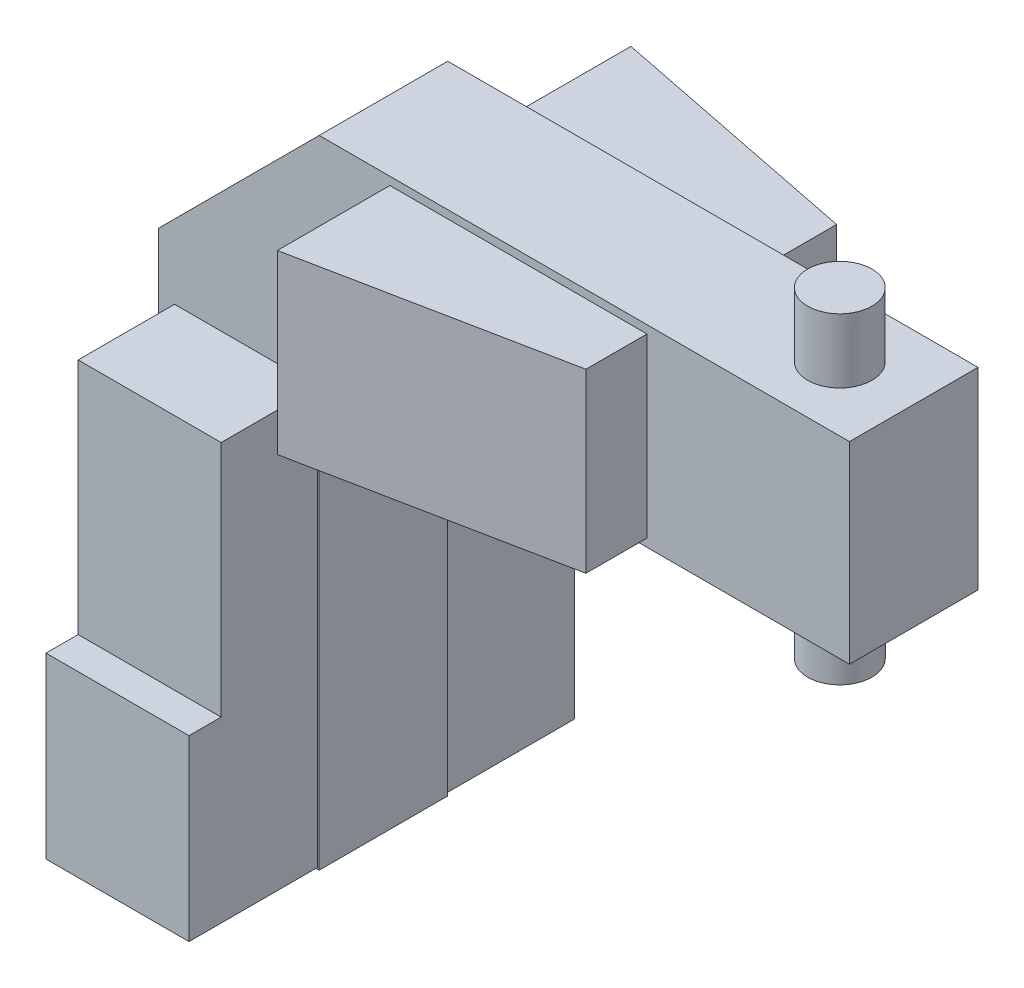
ISO-10303-21;
HEADER;
FILE_DESCRIPTION(('STEP AP214'),'2;1');
FILE_NAME('part.step','',(''),(''),'','','');
FILE_SCHEMA(('AUTOMOTIVE_DESIGN { 1 0 10303 214 1 1 1 1 }'));
ENDSEC;
DATA;
#1=APPLICATION_CONTEXT('core data for automotive mechanical design processes');
#2=APPLICATION_PROTOCOL_DEFINITION('international standard','automotive_design',2000,#1);
#3=PRODUCT_CONTEXT('',#1,'mechanical');
#4=PRODUCT('Part','Part','',(#3));
#5=PRODUCT_RELATED_PRODUCT_CATEGORY('part','',(#4));
#6=PRODUCT_DEFINITION_FORMATION('','',#4);
#7=PRODUCT_DEFINITION_CONTEXT('part definition',#1,'design');
#8=PRODUCT_DEFINITION('design','',#6,#7);
#9=PRODUCT_DEFINITION_SHAPE('','',#8);
#10=(LENGTH_UNIT() NAMED_UNIT(*) SI_UNIT(.MILLI.,.METRE.));
#11=(NAMED_UNIT(*) PLANE_ANGLE_UNIT() SI_UNIT($,.RADIAN.));
#12=(NAMED_UNIT(*) SI_UNIT($,.STERADIAN.) SOLID_ANGLE_UNIT());
#13=UNCERTAINTY_MEASURE_WITH_UNIT(LENGTH_MEASURE(1.E-05),#10,'distance_accuracy_value','');
#14=(GEOMETRIC_REPRESENTATION_CONTEXT(3) GLOBAL_UNCERTAINTY_ASSIGNED_CONTEXT((#13)) GLOBAL_UNIT_ASSIGNED_CONTEXT((#10,
#11,#12)) REPRESENTATION_CONTEXT('',''));
#15=CARTESIAN_POINT('',(0.,0.,0.));
#16=DIRECTION('',(0.,0.,1.));
#17=DIRECTION('',(1.,0.,0.));
#18=AXIS2_PLACEMENT_3D('',#15,#16,#17);
#19=CARTESIAN_POINT('',(-250.,108.15,-60.));
#20=DIRECTION('',(-1.,0.,0.));
#21=DIRECTION('',(0.,0.,1.));
#22=AXIS2_PLACEMENT_3D('',#19,#20,#21);
#23=PLANE('',#22);
#24=DIRECTION('',(0.,0.,1.));
#25=VECTOR('',#24,1.);
#26=CARTESIAN_POINT('',(-250.,163.15,-60.));
#27=LINE('',#26,#25);
#28=CARTESIAN_POINT('',(-250.,163.15,-55.));
#29=VERTEX_POINT('',#28);
#30=CARTESIAN_POINT('',(-250.,163.15,-20.));
#31=VERTEX_POINT('',#30);
#32=EDGE_CURVE('E231',#29,#31,#27,.T.);
#33=ORIENTED_EDGE('',*,*,#32,.F.);
#34=DIRECTION('',(0.,1.,0.));
#35=VECTOR('',#34,1.);
#36=CARTESIAN_POINT('',(-250.,-32.351,-55.));
#37=LINE('',#36,#35);
#38=CARTESIAN_POINT('',(-250.,108.15,-55.));
#39=VERTEX_POINT('',#38);
#40=EDGE_CURVE('E218',#39,#29,#37,.T.);
#41=ORIENTED_EDGE('',*,*,#40,.F.);
#42=DIRECTION('',(0.,0.,1.));
#43=VECTOR('',#42,1.);
#44=CARTESIAN_POINT('',(-250.,108.15,-60.));
#45=LINE('',#44,#43);
#46=CARTESIAN_POINT('',(-250.,108.15,-20.));
#47=VERTEX_POINT('',#46);
#48=EDGE_CURVE('E793',#39,#47,#45,.T.);
#49=ORIENTED_EDGE('',*,*,#48,.T.);
#50=DIRECTION('',(0.,-1.,0.));
#51=VECTOR('',#50,1.);
#52=CARTESIAN_POINT('',(-250.,108.15,-20.));
#53=LINE('',#52,#51);
#54=EDGE_CURVE('E236',#31,#47,#53,.T.);
#55=ORIENTED_EDGE('',*,*,#54,.F.);
#56=EDGE_LOOP('',(#33,#41,#49,#55));
#57=FACE_BOUND('',#56,.T.);
#58=ADVANCED_FACE('F17',(#57),#23,.T.);
#59=CARTESIAN_POINT('',(-250.,163.15,-60.));
#60=DIRECTION('',(0.,1.,0.));
#61=DIRECTION('',(0.,0.,1.));
#62=AXIS2_PLACEMENT_3D('',#59,#60,#61);
#63=PLANE('',#62);
#64=DIRECTION('',(0.,0.,1.));
#65=VECTOR('',#64,1.);
#66=CARTESIAN_POINT('',(-170.,163.15,-60.));
#67=LINE('',#66,#65);
#68=CARTESIAN_POINT('',(-170.,163.15,-39.));
#69=VERTEX_POINT('',#68);
#70=CARTESIAN_POINT('',(-170.,163.15,-20.));
#71=VERTEX_POINT('',#70);
#72=EDGE_CURVE('E233',#69,#71,#67,.T.);
#73=ORIENTED_EDGE('',*,*,#72,.F.);
#74=DIRECTION('',(-0.980580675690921,0.,-0.196116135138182));
#75=VECTOR('',#74,1.);
#76=CARTESIAN_POINT('',(-170.,163.15,-39.));
#77=LINE('',#76,#75);
#78=EDGE_CURVE('E221',#69,#29,#77,.T.);
#79=ORIENTED_EDGE('',*,*,#78,.T.);
#80=ORIENTED_EDGE('',*,*,#32,.T.);
#81=DIRECTION('',(-1.,0.,0.));
#82=VECTOR('',#81,1.);
#83=CARTESIAN_POINT('',(-250.,163.15,-20.));
#84=LINE('',#83,#82);
#85=EDGE_CURVE('E532',#71,#31,#84,.T.);
#86=ORIENTED_EDGE('',*,*,#85,.F.);
#87=EDGE_LOOP('',(#73,#79,#80,#86));
#88=FACE_BOUND('',#87,.T.);
#89=ADVANCED_FACE('F229',(#88),#63,.T.);
#90=CARTESIAN_POINT('',(-170.,163.15,-60.));
#91=DIRECTION('',(1.,0.,0.));
#92=DIRECTION('',(0.,0.,-1.));
#93=AXIS2_PLACEMENT_3D('',#90,#91,#92);
#94=PLANE('',#93);
#95=DIRECTION('',(0.,0.,1.));
#96=VECTOR('',#95,1.);
#97=CARTESIAN_POINT('',(-170.,108.15,-60.));
#98=LINE('',#97,#96);
#99=CARTESIAN_POINT('',(-170.,108.15,-39.));
#100=VERTEX_POINT('',#99);
#101=CARTESIAN_POINT('',(-170.,108.15,-20.));
#102=VERTEX_POINT('',#101);
#103=EDGE_CURVE('E242',#100,#102,#98,.T.);
#104=ORIENTED_EDGE('',*,*,#103,.F.);
#105=DIRECTION('',(0.,1.,0.));
#106=VECTOR('',#105,1.);
#107=CARTESIAN_POINT('',(-170.,-32.351,-39.));
#108=LINE('',#107,#106);
#109=EDGE_CURVE('E32',#100,#69,#108,.T.);
#110=ORIENTED_EDGE('',*,*,#109,.T.);
#111=ORIENTED_EDGE('',*,*,#72,.T.);
#112=DIRECTION('',(0.,1.,0.));
#113=VECTOR('',#112,1.);
#114=CARTESIAN_POINT('',(-170.,163.15,-20.));
#115=LINE('',#114,#113);
#116=EDGE_CURVE('E790',#102,#71,#115,.T.);
#117=ORIENTED_EDGE('',*,*,#116,.F.);
#118=EDGE_LOOP('',(#104,#110,#111,#117));
#119=FACE_BOUND('',#118,.T.);
#120=ADVANCED_FACE('F463',(#119),#94,.T.);
#121=CARTESIAN_POINT('',(-170.,108.15,-60.));
#122=DIRECTION('',(0.,-1.,0.));
#123=DIRECTION('',(0.,0.,-1.));
#124=AXIS2_PLACEMENT_3D('',#121,#122,#123);
#125=PLANE('',#124);
#126=ORIENTED_EDGE('',*,*,#48,.F.);
#127=DIRECTION('',(-0.980580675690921,0.,-0.196116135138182));
#128=VECTOR('',#127,1.);
#129=CARTESIAN_POINT('',(-170.,108.15,-39.));
#130=LINE('',#129,#128);
#131=EDGE_CURVE('E222',#100,#39,#130,.T.);
#132=ORIENTED_EDGE('',*,*,#131,.F.);
#133=ORIENTED_EDGE('',*,*,#103,.T.);
#134=DIRECTION('',(1.,0.,0.));
#135=VECTOR('',#134,1.);
#136=CARTESIAN_POINT('',(-170.,108.15,-20.));
#137=LINE('',#136,#135);
#138=EDGE_CURVE('E794',#47,#102,#137,.T.);
#139=ORIENTED_EDGE('',*,*,#138,.F.);
#140=EDGE_LOOP('',(#126,#132,#133,#139));
#141=FACE_BOUND('',#140,.T.);
#142=ADVANCED_FACE('F753',(#141),#125,.T.);
#143=CARTESIAN_POINT('',(-317.,97.65,-60.));
#144=DIRECTION('',(0.,1.,0.));
#145=DIRECTION('',(0.,0.,1.));
#146=AXIS2_PLACEMENT_3D('',#143,#144,#145);
#147=PLANE('',#146);
#148=DIRECTION('',(0.,0.,1.));
#149=VECTOR('',#148,1.);
#150=CARTESIAN_POINT('',(-272.5,97.65,-60.));
#151=LINE('',#150,#149);
#152=CARTESIAN_POINT('',(-272.5,97.65,-50.));
#153=VERTEX_POINT('',#152);
#154=CARTESIAN_POINT('',(-272.5,97.65,-20.));
#155=VERTEX_POINT('',#154);
#156=EDGE_CURVE('E801',#153,#155,#151,.T.);
#157=ORIENTED_EDGE('',*,*,#156,.F.);
#158=DIRECTION('',(-1.,0.,0.));
#159=VECTOR('',#158,1.);
#160=CARTESIAN_POINT('',(-107.,97.65,-50.));
#161=LINE('',#160,#159);
#162=CARTESIAN_POINT('',(-317.,97.65,-50.));
#163=VERTEX_POINT('',#162);
#164=EDGE_CURVE('E830',#153,#163,#161,.T.);
#165=ORIENTED_EDGE('',*,*,#164,.T.);
#166=DIRECTION('',(0.,0.,1.));
#167=VECTOR('',#166,1.);
#168=CARTESIAN_POINT('',(-317.,97.65,-60.));
#169=LINE('',#168,#167);
#170=CARTESIAN_POINT('',(-317.,97.65,-20.));
#171=VERTEX_POINT('',#170);
#172=EDGE_CURVE('E808',#163,#171,#169,.T.);
#173=ORIENTED_EDGE('',*,*,#172,.T.);
#174=DIRECTION('',(-1.,0.,0.));
#175=VECTOR('',#174,1.);
#176=CARTESIAN_POINT('',(-317.,97.65,-20.));
#177=LINE('',#176,#175);
#178=EDGE_CURVE('E824',#155,#171,#177,.T.);
#179=ORIENTED_EDGE('',*,*,#178,.F.);
#180=EDGE_LOOP('',(#157,#165,#173,#179));
#181=FACE_BOUND('',#180,.T.);
#182=ADVANCED_FACE('F745',(#181),#147,.T.);
#183=CARTESIAN_POINT('',(-272.5,97.65,-60.));
#184=DIRECTION('',(1.,0.,0.));
#185=DIRECTION('',(0.,1.,0.));
#186=AXIS2_PLACEMENT_3D('',#183,#184,#185);
#187=PLANE('',#186);
#188=DIRECTION('',(0.,0.,1.));
#189=VECTOR('',#188,1.);
#190=CARTESIAN_POINT('',(-272.5,23.65,-60.));
#191=LINE('',#190,#189);
#192=CARTESIAN_POINT('',(-272.5,23.65,-60.));
#193=VERTEX_POINT('',#192);
#194=CARTESIAN_POINT('',(-272.5,23.65,-50.));
#195=VERTEX_POINT('',#194);
#196=EDGE_CURVE('E40',#193,#195,#191,.T.);
#197=ORIENTED_EDGE('',*,*,#196,.T.);
#198=DIRECTION('',(0.,1.,0.));
#199=VECTOR('',#198,1.);
#200=CARTESIAN_POINT('',(-272.5,97.65,-50.));
#201=LINE('',#200,#199);
#202=EDGE_CURVE('E826',#195,#153,#201,.T.);
#203=ORIENTED_EDGE('',*,*,#202,.T.);
#204=ORIENTED_EDGE('',*,*,#156,.T.);
#205=DIRECTION('',(0.,1.,0.));
#206=VECTOR('',#205,1.);
#207=CARTESIAN_POINT('',(-272.5,97.65,-20.));
#208=LINE('',#207,#206);
#209=CARTESIAN_POINT('',(-272.5,-31.85,-20.));
#210=VERTEX_POINT('',#209);
#211=EDGE_CURVE('E529',#210,#155,#208,.T.);
#212=ORIENTED_EDGE('',*,*,#211,.F.);
#213=DIRECTION('',(0.,0.,1.));
#214=VECTOR('',#213,1.);
#215=CARTESIAN_POINT('',(-272.5,-31.85,-60.));
#216=LINE('',#215,#214);
#217=CARTESIAN_POINT('',(-272.5,-31.85,-60.));
#218=VERTEX_POINT('',#217);
#219=EDGE_CURVE('E803',#218,#210,#216,.T.);
#220=ORIENTED_EDGE('',*,*,#219,.F.);
#221=DIRECTION('',(0.,1.,0.));
#222=VECTOR('',#221,1.);
#223=CARTESIAN_POINT('',(-272.5,97.65,-60.));
#224=LINE('',#223,#222);
#225=EDGE_CURVE('E815',#218,#193,#224,.T.);
#226=ORIENTED_EDGE('',*,*,#225,.T.);
#227=EDGE_LOOP('',(#197,#203,#204,#212,#220,#226));
#228=FACE_BOUND('',#227,.T.);
#229=ADVANCED_FACE('F737',(#228),#187,.T.);
#230=CARTESIAN_POINT('',(-317.,-31.85,-60.));
#231=DIRECTION('',(-1.,0.,0.));
#232=DIRECTION('',(0.,0.,1.));
#233=AXIS2_PLACEMENT_3D('',#230,#231,#232);
#234=PLANE('',#233);
#235=ORIENTED_EDGE('',*,*,#172,.F.);
#236=DIRECTION('',(0.,-1.,0.));
#237=VECTOR('',#236,1.);
#238=CARTESIAN_POINT('',(-317.,97.65,-50.));
#239=LINE('',#238,#237);
#240=CARTESIAN_POINT('',(-317.,23.65,-50.));
#241=VERTEX_POINT('',#240);
#242=EDGE_CURVE('E833',#163,#241,#239,.T.);
#243=ORIENTED_EDGE('',*,*,#242,.T.);
#244=DIRECTION('',(0.,0.,-1.));
#245=VECTOR('',#244,1.);
#246=CARTESIAN_POINT('',(-317.,23.65,-50.));
#247=LINE('',#246,#245);
#248=CARTESIAN_POINT('',(-317.,23.65,-60.));
#249=VERTEX_POINT('',#248);
#250=EDGE_CURVE('E838',#241,#249,#247,.T.);
#251=ORIENTED_EDGE('',*,*,#250,.T.);
#252=DIRECTION('',(0.,-1.,0.));
#253=VECTOR('',#252,1.);
#254=CARTESIAN_POINT('',(-317.,-31.85,-60.));
#255=LINE('',#254,#253);
#256=CARTESIAN_POINT('',(-317.,-31.85,-60.));
#257=VERTEX_POINT('',#256);
#258=EDGE_CURVE('E810',#249,#257,#255,.T.);
#259=ORIENTED_EDGE('',*,*,#258,.T.);
#260=DIRECTION('',(0.,0.,1.));
#261=VECTOR('',#260,1.);
#262=CARTESIAN_POINT('',(-317.,-31.85,-60.));
#263=LINE('',#262,#261);
#264=CARTESIAN_POINT('',(-317.,-31.85,-20.));
#265=VERTEX_POINT('',#264);
#266=EDGE_CURVE('E805',#257,#265,#263,.T.);
#267=ORIENTED_EDGE('',*,*,#266,.T.);
#268=DIRECTION('',(0.,-1.,0.));
#269=VECTOR('',#268,1.);
#270=CARTESIAN_POINT('',(-317.,-31.85,-20.));
#271=LINE('',#270,#269);
#272=EDGE_CURVE('E818',#171,#265,#271,.T.);
#273=ORIENTED_EDGE('',*,*,#272,.F.);
#274=EDGE_LOOP('',(#235,#243,#251,#259,#267,#273));
#275=FACE_BOUND('',#274,.T.);
#276=ADVANCED_FACE('F450',(#275),#234,.T.);
#277=CARTESIAN_POINT('',(-317.,97.65,-60.));
#278=DIRECTION('',(0.,0.,-1.));
#279=DIRECTION('',(1.,0.,0.));
#280=AXIS2_PLACEMENT_3D('',#277,#278,#279);
#281=PLANE('',#280);
#282=ORIENTED_EDGE('',*,*,#258,.F.);
#283=DIRECTION('',(1.,0.,0.));
#284=VECTOR('',#283,1.);
#285=CARTESIAN_POINT('',(-317.,23.65,-60.));
#286=LINE('',#285,#284);
#287=EDGE_CURVE('E11',#249,#193,#286,.T.);
#288=ORIENTED_EDGE('',*,*,#287,.T.);
#289=ORIENTED_EDGE('',*,*,#225,.F.);
#290=DIRECTION('',(1.,0.,0.));
#291=VECTOR('',#290,1.);
#292=CARTESIAN_POINT('',(-272.5,-31.85,-60.));
#293=LINE('',#292,#291);
#294=EDGE_CURVE('E812',#257,#218,#293,.T.);
#295=ORIENTED_EDGE('',*,*,#294,.F.);
#296=EDGE_LOOP('',(#282,#288,#289,#295));
#297=FACE_BOUND('',#296,.T.);
#298=ADVANCED_FACE('F438',(#297),#281,.T.);
#299=CARTESIAN_POINT('',(-252.,85.65,20.));
#300=DIRECTION('',(0.,0.,1.));
#301=DIRECTION('',(1.,0.,0.));
#302=AXIS2_PLACEMENT_3D('',#299,#300,#301);
#303=PLANE('',#302);
#304=DIRECTION('',(1.,0.,0.));
#305=VECTOR('',#304,1.);
#306=CARTESIAN_POINT('',(-170.,108.15,20.));
#307=LINE('',#306,#305);
#308=CARTESIAN_POINT('',(-250.,108.15,20.));
#309=VERTEX_POINT('',#308);
#310=CARTESIAN_POINT('',(-170.,108.15,20.));
#311=VERTEX_POINT('',#310);
#312=EDGE_CURVE('E294',#309,#311,#307,.T.);
#313=ORIENTED_EDGE('',*,*,#312,.F.);
#314=DIRECTION('',(0.,-1.,0.));
#315=VECTOR('',#314,1.);
#316=CARTESIAN_POINT('',(-250.,108.15,20.));
#317=LINE('',#316,#315);
#318=CARTESIAN_POINT('',(-250.,163.15,20.));
#319=VERTEX_POINT('',#318);
#320=EDGE_CURVE('E291',#319,#309,#317,.T.);
#321=ORIENTED_EDGE('',*,*,#320,.F.);
#322=DIRECTION('',(-1.,0.,0.));
#323=VECTOR('',#322,1.);
#324=CARTESIAN_POINT('',(-250.,163.15,20.));
#325=LINE('',#324,#323);
#326=CARTESIAN_POINT('',(-170.,163.15,20.));
#327=VERTEX_POINT('',#326);
#328=EDGE_CURVE('E300',#327,#319,#325,.T.);
#329=ORIENTED_EDGE('',*,*,#328,.F.);
#330=DIRECTION('',(0.,1.,0.));
#331=VECTOR('',#330,1.);
#332=CARTESIAN_POINT('',(-170.,163.15,20.));
#333=LINE('',#332,#331);
#334=EDGE_CURVE('E297',#311,#327,#333,.T.);
#335=ORIENTED_EDGE('',*,*,#334,.F.);
#336=EDGE_LOOP('',(#313,#321,#329,#335));
#337=FACE_BOUND('',#336,.T.);
#338=DIRECTION('',(0.573576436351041,-0.819152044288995,0.));
#339=VECTOR('',#338,1.);
#340=CARTESIAN_POINT('',(-322.,-32.35,20.));
#341=LINE('',#340,#339);
#342=CARTESIAN_POINT('',(-342.,-3.78703986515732,20.));
#343=VERTEX_POINT('',#342);
#344=CARTESIAN_POINT('',(-322.,-32.35,20.));
#345=VERTEX_POINT('',#344);
#346=EDGE_CURVE('E345',#343,#345,#341,.T.);
#347=ORIENTED_EDGE('',*,*,#346,.T.);
#348=DIRECTION('',(1.,0.,0.));
#349=VECTOR('',#348,1.);
#350=CARTESIAN_POINT('',(-322.,-32.35,20.));
#351=LINE('',#350,#349);
#352=CARTESIAN_POINT('',(-272.,-32.35,20.));
#353=VERTEX_POINT('',#352);
#354=EDGE_CURVE('E348',#345,#353,#351,.T.);
#355=ORIENTED_EDGE('',*,*,#354,.T.);
#356=DIRECTION('',(0.,1.,0.));
#357=VECTOR('',#356,1.);
#358=CARTESIAN_POINT('',(-272.,-32.35,20.));
#359=LINE('',#358,#357);
#360=CARTESIAN_POINT('',(-272.,85.65,20.));
#361=VERTEX_POINT('',#360);
#362=EDGE_CURVE('E350',#353,#361,#359,.T.);
#363=ORIENTED_EDGE('',*,*,#362,.T.);
#364=CARTESIAN_POINT('',(-252.,85.65,20.));
#365=DIRECTION('',(0.,0.,-1.));
#366=DIRECTION('',(1.,0.,0.));
#367=AXIS2_PLACEMENT_3D('',#364,#365,#366);
#368=CIRCLE('',#367,20.);
#369=CARTESIAN_POINT('',(-252.,105.65,20.));
#370=VERTEX_POINT('',#369);
#371=EDGE_CURVE('E352',#361,#370,#368,.T.);
#372=ORIENTED_EDGE('',*,*,#371,.T.);
#373=DIRECTION('',(1.,0.,0.));
#374=VECTOR('',#373,1.);
#375=CARTESIAN_POINT('',(-252.,105.65,20.));
#376=LINE('',#375,#374);
#377=CARTESIAN_POINT('',(-107.,105.65,20.));
#378=VERTEX_POINT('',#377);
#379=EDGE_CURVE('E354',#370,#378,#376,.T.);
#380=ORIENTED_EDGE('',*,*,#379,.T.);
#381=DIRECTION('',(0.,1.,0.));
#382=VECTOR('',#381,1.);
#383=CARTESIAN_POINT('',(-107.,165.65,20.));
#384=LINE('',#383,#382);
#385=CARTESIAN_POINT('',(-107.,165.65,20.));
#386=VERTEX_POINT('',#385);
#387=EDGE_CURVE('E356',#378,#386,#384,.T.);
#388=ORIENTED_EDGE('',*,*,#387,.T.);
#389=DIRECTION('',(-1.,0.,0.));
#390=VECTOR('',#389,1.);
#391=CARTESIAN_POINT('',(-107.,165.65,20.));
#392=LINE('',#391,#390);
#393=CARTESIAN_POINT('',(-272.,165.65,20.));
#394=VERTEX_POINT('',#393);
#395=EDGE_CURVE('E358',#386,#394,#392,.T.);
#396=ORIENTED_EDGE('',*,*,#395,.T.);
#397=DIRECTION('',(-0.707106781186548,-0.707106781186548,0.));
#398=VECTOR('',#397,1.);
#399=CARTESIAN_POINT('',(-272.,165.65,20.));
#400=LINE('',#399,#398);
#401=CARTESIAN_POINT('',(-322.,115.65,20.));
#402=VERTEX_POINT('',#401);
#403=EDGE_CURVE('E360',#394,#402,#400,.T.);
#404=ORIENTED_EDGE('',*,*,#403,.T.);
#405=DIRECTION('',(0.,-1.,0.));
#406=VECTOR('',#405,1.);
#407=CARTESIAN_POINT('',(-322.,115.65,20.));
#408=LINE('',#407,#406);
#409=CARTESIAN_POINT('',(-322.,21.65,20.));
#410=VERTEX_POINT('',#409);
#411=EDGE_CURVE('E362',#402,#410,#408,.T.);
#412=ORIENTED_EDGE('',*,*,#411,.T.);
#413=DIRECTION('',(-1.,0.,0.));
#414=VECTOR('',#413,1.);
#415=CARTESIAN_POINT('',(-322.,21.65,20.));
#416=LINE('',#415,#414);
#417=CARTESIAN_POINT('',(-342.,21.65,20.));
#418=VERTEX_POINT('',#417);
#419=EDGE_CURVE('E364',#410,#418,#416,.T.);
#420=ORIENTED_EDGE('',*,*,#419,.T.);
#421=DIRECTION('',(0.,-1.,0.));
#422=VECTOR('',#421,1.);
#423=CARTESIAN_POINT('',(-342.,-3.78703986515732,20.));
#424=LINE('',#423,#422);
#425=EDGE_CURVE('E366',#418,#343,#424,.T.);
#426=ORIENTED_EDGE('',*,*,#425,.T.);
#427=EDGE_LOOP('',(#347,#355,#363,#372,#380,#388,#396,#404,#412,#420,#426));
#428=FACE_BOUND('',#427,.T.);
#429=DIRECTION('',(0.,-1.,0.));
#430=VECTOR('',#429,1.);
#431=CARTESIAN_POINT('',(-317.,-31.85,20.));
#432=LINE('',#431,#430);
#433=CARTESIAN_POINT('',(-317.,97.65,20.));
#434=VERTEX_POINT('',#433);
#435=CARTESIAN_POINT('',(-317.,-31.85,20.));
#436=VERTEX_POINT('',#435);
#437=EDGE_CURVE('E267',#434,#436,#432,.T.);
#438=ORIENTED_EDGE('',*,*,#437,.F.);
#439=DIRECTION('',(-1.,0.,0.));
#440=VECTOR('',#439,1.);
#441=CARTESIAN_POINT('',(-317.,97.65,20.));
#442=LINE('',#441,#440);
#443=CARTESIAN_POINT('',(-272.5,97.65,20.));
#444=VERTEX_POINT('',#443);
#445=EDGE_CURVE('E264',#444,#434,#442,.T.);
#446=ORIENTED_EDGE('',*,*,#445,.F.);
#447=DIRECTION('',(0.,1.,0.));
#448=VECTOR('',#447,1.);
#449=CARTESIAN_POINT('',(-272.5,97.65,20.));
#450=LINE('',#449,#448);
#451=CARTESIAN_POINT('',(-272.5,-31.85,20.));
#452=VERTEX_POINT('',#451);
#453=EDGE_CURVE('E272',#452,#444,#450,.T.);
#454=ORIENTED_EDGE('',*,*,#453,.F.);
#455=DIRECTION('',(1.,0.,0.));
#456=VECTOR('',#455,1.);
#457=CARTESIAN_POINT('',(-272.5,-31.85,20.));
#458=LINE('',#457,#456);
#459=EDGE_CURVE('E269',#436,#452,#458,.T.);
#460=ORIENTED_EDGE('',*,*,#459,.F.);
#461=EDGE_LOOP('',(#438,#446,#454,#460));
#462=FACE_BOUND('',#461,.T.);
#463=ADVANCED_FACE('F435',(#337,#428,#462),#303,.T.);
#464=CARTESIAN_POINT('',(-252.,105.65,20.));
#465=DIRECTION('',(0.,1.,0.));
#466=DIRECTION('',(0.,0.,1.));
#467=AXIS2_PLACEMENT_3D('',#464,#465,#466);
#468=PLANE('',#467);
#469=DIRECTION('',(1.,0.,0.));
#470=VECTOR('',#469,1.);
#471=CARTESIAN_POINT('',(-252.,105.65,-20.));
#472=LINE('',#471,#470);
#473=CARTESIAN_POINT('',(-252.,105.65,-20.));
#474=VERTEX_POINT('',#473);
#475=CARTESIAN_POINT('',(-107.,105.65,-20.));
#476=VERTEX_POINT('',#475);
#477=EDGE_CURVE('E331',#474,#476,#472,.T.);
#478=ORIENTED_EDGE('',*,*,#477,.T.);
#479=DIRECTION('',(0.,0.,-1.));
#480=VECTOR('',#479,1.);
#481=CARTESIAN_POINT('',(-107.,105.65,20.));
#482=LINE('',#481,#480);
#483=EDGE_CURVE('E386',#378,#476,#482,.T.);
#484=ORIENTED_EDGE('',*,*,#483,.F.);
#485=ORIENTED_EDGE('',*,*,#379,.F.);
#486=DIRECTION('',(0.,0.,-1.));
#487=VECTOR('',#486,1.);
#488=CARTESIAN_POINT('',(-252.,105.65,20.));
#489=LINE('',#488,#487);
#490=EDGE_CURVE('E389',#370,#474,#489,.T.);
#491=ORIENTED_EDGE('',*,*,#490,.T.);
#492=EDGE_LOOP('',(#478,#484,#485,#491));
#493=FACE_BOUND('',#492,.T.);
#494=CARTESIAN_POINT('',(-130.,105.65,0.));
#495=DIRECTION('',(0.,1.,0.));
#496=DIRECTION('',(0.,0.,1.));
#497=AXIS2_PLACEMENT_3D('',#494,#495,#496);
#498=CIRCLE('',#497,10.);
#499=CARTESIAN_POINT('',(-130.,105.65,10.));
#500=VERTEX_POINT('',#499);
#501=EDGE_CURVE('E318',#500,#500,#498,.F.);
#502=ORIENTED_EDGE('',*,*,#501,.F.);
#503=EDGE_LOOP('',(#502));
#504=FACE_BOUND('',#503,.T.);
#505=ADVANCED_FACE('F437',(#493,#504),#468,.F.);
#506=CARTESIAN_POINT('',(-107.,165.65,20.));
#507=DIRECTION('',(0.,-1.,0.));
#508=DIRECTION('',(0.,0.,-1.));
#509=AXIS2_PLACEMENT_3D('',#506,#507,#508);
#510=PLANE('',#509);
#511=DIRECTION('',(-1.,0.,0.));
#512=VECTOR('',#511,1.);
#513=CARTESIAN_POINT('',(-107.,165.65,-20.));
#514=LINE('',#513,#512);
#515=CARTESIAN_POINT('',(-107.,165.65,-20.));
#516=VERTEX_POINT('',#515);
#517=CARTESIAN_POINT('',(-272.,165.65,-20.));
#518=VERTEX_POINT('',#517);
#519=EDGE_CURVE('E335',#516,#518,#514,.T.);
#520=ORIENTED_EDGE('',*,*,#519,.T.);
#521=DIRECTION('',(0.,0.,-1.));
#522=VECTOR('',#521,1.);
#523=CARTESIAN_POINT('',(-272.,165.65,20.));
#524=LINE('',#523,#522);
#525=EDGE_CURVE('E380',#394,#518,#524,.T.);
#526=ORIENTED_EDGE('',*,*,#525,.F.);
#527=ORIENTED_EDGE('',*,*,#395,.F.);
#528=DIRECTION('',(0.,0.,-1.));
#529=VECTOR('',#528,1.);
#530=CARTESIAN_POINT('',(-107.,165.65,20.));
#531=LINE('',#530,#529);
#532=EDGE_CURVE('E383',#386,#516,#531,.T.);
#533=ORIENTED_EDGE('',*,*,#532,.T.);
#534=EDGE_LOOP('',(#520,#526,#527,#533));
#535=FACE_BOUND('',#534,.T.);
#536=CARTESIAN_POINT('',(-130.,165.65,0.));
#537=DIRECTION('',(0.,-1.,0.));
#538=DIRECTION('',(0.,0.,-1.));
#539=AXIS2_PLACEMENT_3D('',#536,#537,#538);
#540=CIRCLE('',#539,10.);
#541=CARTESIAN_POINT('',(-130.,165.65,-9.99999999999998));
#542=VERTEX_POINT('',#541);
#543=EDGE_CURVE('E322',#542,#542,#540,.F.);
#544=ORIENTED_EDGE('',*,*,#543,.F.);
#545=EDGE_LOOP('',(#544));
#546=FACE_BOUND('',#545,.T.);
#547=ADVANCED_FACE('F447',(#535,#546),#510,.F.);
#548=CARTESIAN_POINT('',(-322.,-32.35,20.));
#549=DIRECTION('',(0.819152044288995,0.573576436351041,0.));
#550=DIRECTION('',(-0.573576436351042,0.819152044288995,0.));
#551=AXIS2_PLACEMENT_3D('',#548,#549,#550);
#552=PLANE('',#551);
#553=DIRECTION('',(0.573576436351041,-0.819152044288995,0.));
#554=VECTOR('',#553,1.);
#555=CARTESIAN_POINT('',(-322.,-32.35,-20.));
#556=LINE('',#555,#554);
#557=CARTESIAN_POINT('',(-342.,-3.78703986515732,-20.));
#558=VERTEX_POINT('',#557);
#559=CARTESIAN_POINT('',(-322.,-32.35,-20.));
#560=VERTEX_POINT('',#559);
#561=EDGE_CURVE('E317',#558,#560,#556,.T.);
#562=ORIENTED_EDGE('',*,*,#561,.T.);
#563=DIRECTION('',(0.,0.,-1.));
#564=VECTOR('',#563,1.);
#565=CARTESIAN_POINT('',(-322.,-32.35,20.));
#566=LINE('',#565,#564);
#567=EDGE_CURVE('E398',#345,#560,#566,.T.);
#568=ORIENTED_EDGE('',*,*,#567,.F.);
#569=ORIENTED_EDGE('',*,*,#346,.F.);
#570=DIRECTION('',(0.,0.,-1.));
#571=VECTOR('',#570,1.);
#572=CARTESIAN_POINT('',(-342.,-3.78703986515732,20.));
#573=LINE('',#572,#571);
#574=EDGE_CURVE('E368',#343,#558,#573,.T.);
#575=ORIENTED_EDGE('',*,*,#574,.T.);
#576=EDGE_LOOP('',(#562,#568,#569,#575));
#577=FACE_BOUND('',#576,.T.);
#578=ADVANCED_FACE('F19',(#577),#552,.F.);
#579=CARTESIAN_POINT('',(-322.,-32.35,20.));
#580=DIRECTION('',(0.,1.,0.));
#581=DIRECTION('',(0.,0.,1.));
#582=AXIS2_PLACEMENT_3D('',#579,#580,#581);
#583=PLANE('',#582);
#584=DIRECTION('',(1.,0.,0.));
#585=VECTOR('',#584,1.);
#586=CARTESIAN_POINT('',(-322.,-32.35,-20.));
#587=LINE('',#586,#585);
#588=CARTESIAN_POINT('',(-272.,-32.35,-20.));
#589=VERTEX_POINT('',#588);
#590=EDGE_CURVE('E325',#560,#589,#587,.T.);
#591=ORIENTED_EDGE('',*,*,#590,.T.);
#592=DIRECTION('',(0.,0.,-1.));
#593=VECTOR('',#592,1.);
#594=CARTESIAN_POINT('',(-272.,-32.35,20.));
#595=LINE('',#594,#593);
#596=EDGE_CURVE('E395',#353,#589,#595,.T.);
#597=ORIENTED_EDGE('',*,*,#596,.F.);
#598=ORIENTED_EDGE('',*,*,#354,.F.);
#599=ORIENTED_EDGE('',*,*,#567,.T.);
#600=EDGE_LOOP('',(#591,#597,#598,#599));
#601=FACE_BOUND('',#600,.T.);
#602=ADVANCED_FACE('F580',(#601),#583,.F.);
#603=CARTESIAN_POINT('',(-272.,-32.35,20.));
#604=DIRECTION('',(-1.,0.,0.));
#605=DIRECTION('',(0.,0.,1.));
#606=AXIS2_PLACEMENT_3D('',#603,#604,#605);
#607=PLANE('',#606);
#608=DIRECTION('',(0.,1.,0.));
#609=VECTOR('',#608,1.);
#610=CARTESIAN_POINT('',(-272.,-32.35,-20.));
#611=LINE('',#610,#609);
#612=CARTESIAN_POINT('',(-272.,85.65,-20.));
#613=VERTEX_POINT('',#612);
#614=EDGE_CURVE('E327',#589,#613,#611,.T.);
#615=ORIENTED_EDGE('',*,*,#614,.T.);
#616=DIRECTION('',(0.,0.,-1.));
#617=VECTOR('',#616,1.);
#618=CARTESIAN_POINT('',(-272.,85.65,20.));
#619=LINE('',#618,#617);
#620=EDGE_CURVE('E392',#361,#613,#619,.T.);
#621=ORIENTED_EDGE('',*,*,#620,.F.);
#622=ORIENTED_EDGE('',*,*,#362,.F.);
#623=ORIENTED_EDGE('',*,*,#596,.T.);
#624=EDGE_LOOP('',(#615,#621,#622,#623));
#625=FACE_BOUND('',#624,.T.);
#626=ADVANCED_FACE('F576',(#625),#607,.F.);
#627=CARTESIAN_POINT('',(-252.,85.65,20.));
#628=DIRECTION('',(0.,0.,-1.));
#629=DIRECTION('',(-1.,0.,0.));
#630=AXIS2_PLACEMENT_3D('',#627,#628,#629);
#631=CYLINDRICAL_SURFACE('',#630,20.);
#632=CARTESIAN_POINT('',(-252.,85.65,-20.));
#633=DIRECTION('',(0.,0.,-1.));
#634=DIRECTION('',(1.,0.,0.));
#635=AXIS2_PLACEMENT_3D('',#632,#633,#634);
#636=CIRCLE('',#635,20.);
#637=EDGE_CURVE('E329',#613,#474,#636,.T.);
#638=ORIENTED_EDGE('',*,*,#637,.T.);
#639=ORIENTED_EDGE('',*,*,#490,.F.);
#640=ORIENTED_EDGE('',*,*,#371,.F.);
#641=ORIENTED_EDGE('',*,*,#620,.T.);
#642=EDGE_LOOP('',(#638,#639,#640,#641));
#643=FACE_BOUND('',#642,.T.);
#644=ADVANCED_FACE('F573',(#643),#631,.F.);
#645=CARTESIAN_POINT('',(-107.,165.65,20.));
#646=DIRECTION('',(-1.,0.,0.));
#647=DIRECTION('',(0.,0.,1.));
#648=AXIS2_PLACEMENT_3D('',#645,#646,#647);
#649=PLANE('',#648);
#650=DIRECTION('',(0.,1.,0.));
#651=VECTOR('',#650,1.);
#652=CARTESIAN_POINT('',(-107.,165.65,-20.));
#653=LINE('',#652,#651);
#654=EDGE_CURVE('E333',#476,#516,#653,.T.);
#655=ORIENTED_EDGE('',*,*,#654,.T.);
#656=ORIENTED_EDGE('',*,*,#532,.F.);
#657=ORIENTED_EDGE('',*,*,#387,.F.);
#658=ORIENTED_EDGE('',*,*,#483,.T.);
#659=EDGE_LOOP('',(#655,#656,#657,#658));
#660=FACE_BOUND('',#659,.T.);
#661=ADVANCED_FACE('F565',(#660),#649,.F.);
#662=CARTESIAN_POINT('',(-272.,165.65,20.));
#663=DIRECTION('',(0.707106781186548,-0.707106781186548,0.));
#664=DIRECTION('',(0.707106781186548,0.707106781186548,0.));
#665=AXIS2_PLACEMENT_3D('',#662,#663,#664);
#666=PLANE('',#665);
#667=DIRECTION('',(-0.707106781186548,-0.707106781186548,0.));
#668=VECTOR('',#667,1.);
#669=CARTESIAN_POINT('',(-272.,165.65,-20.));
#670=LINE('',#669,#668);
#671=CARTESIAN_POINT('',(-322.,115.65,-20.));
#672=VERTEX_POINT('',#671);
#673=EDGE_CURVE('E337',#518,#672,#670,.T.);
#674=ORIENTED_EDGE('',*,*,#673,.T.);
#675=DIRECTION('',(0.,0.,-1.));
#676=VECTOR('',#675,1.);
#677=CARTESIAN_POINT('',(-322.,115.65,20.));
#678=LINE('',#677,#676);
#679=EDGE_CURVE('E377',#402,#672,#678,.T.);
#680=ORIENTED_EDGE('',*,*,#679,.F.);
#681=ORIENTED_EDGE('',*,*,#403,.F.);
#682=ORIENTED_EDGE('',*,*,#525,.T.);
#683=EDGE_LOOP('',(#674,#680,#681,#682));
#684=FACE_BOUND('',#683,.T.);
#685=ADVANCED_FACE('F555',(#684),#666,.F.);
#686=CARTESIAN_POINT('',(-322.,115.65,20.));
#687=DIRECTION('',(1.,0.,0.));
#688=DIRECTION('',(0.,0.,-1.));
#689=AXIS2_PLACEMENT_3D('',#686,#687,#688);
#690=PLANE('',#689);
#691=DIRECTION('',(0.,-1.,0.));
#692=VECTOR('',#691,1.);
#693=CARTESIAN_POINT('',(-322.,115.65,-20.));
#694=LINE('',#693,#692);
#695=CARTESIAN_POINT('',(-322.,21.65,-20.));
#696=VERTEX_POINT('',#695);
#697=EDGE_CURVE('E339',#672,#696,#694,.T.);
#698=ORIENTED_EDGE('',*,*,#697,.T.);
#699=DIRECTION('',(0.,0.,-1.));
#700=VECTOR('',#699,1.);
#701=CARTESIAN_POINT('',(-322.,21.65,20.));
#702=LINE('',#701,#700);
#703=EDGE_CURVE('E374',#410,#696,#702,.T.);
#704=ORIENTED_EDGE('',*,*,#703,.F.);
#705=ORIENTED_EDGE('',*,*,#411,.F.);
#706=ORIENTED_EDGE('',*,*,#679,.T.);
#707=EDGE_LOOP('',(#698,#704,#705,#706));
#708=FACE_BOUND('',#707,.T.);
#709=ADVANCED_FACE('F550',(#708),#690,.F.);
#710=CARTESIAN_POINT('',(-322.,21.65,20.));
#711=DIRECTION('',(0.,-1.,0.));
#712=DIRECTION('',(1.,0.,0.));
#713=AXIS2_PLACEMENT_3D('',#710,#711,#712);
#714=PLANE('',#713);
#715=DIRECTION('',(-1.,0.,0.));
#716=VECTOR('',#715,1.);
#717=CARTESIAN_POINT('',(-322.,21.65,-20.));
#718=LINE('',#717,#716);
#719=CARTESIAN_POINT('',(-342.,21.65,-20.));
#720=VERTEX_POINT('',#719);
#721=EDGE_CURVE('E341',#696,#720,#718,.T.);
#722=ORIENTED_EDGE('',*,*,#721,.T.);
#723=DIRECTION('',(0.,0.,-1.));
#724=VECTOR('',#723,1.);
#725=CARTESIAN_POINT('',(-342.,21.65,20.));
#726=LINE('',#725,#724);
#727=EDGE_CURVE('E371',#418,#720,#726,.T.);
#728=ORIENTED_EDGE('',*,*,#727,.F.);
#729=ORIENTED_EDGE('',*,*,#419,.F.);
#730=ORIENTED_EDGE('',*,*,#703,.T.);
#731=EDGE_LOOP('',(#722,#728,#729,#730));
#732=FACE_BOUND('',#731,.T.);
#733=ADVANCED_FACE('F522',(#732),#714,.F.);
#734=CARTESIAN_POINT('',(-342.,-3.78703986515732,20.));
#735=DIRECTION('',(1.,0.,0.));
#736=DIRECTION('',(0.,0.,-1.));
#737=AXIS2_PLACEMENT_3D('',#734,#735,#736);
#738=PLANE('',#737);
#739=DIRECTION('',(0.,-1.,0.));
#740=VECTOR('',#739,1.);
#741=CARTESIAN_POINT('',(-342.,-3.78703986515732,-20.));
#742=LINE('',#741,#740);
#743=EDGE_CURVE('E343',#720,#558,#742,.T.);
#744=ORIENTED_EDGE('',*,*,#743,.T.);
#745=ORIENTED_EDGE('',*,*,#574,.F.);
#746=ORIENTED_EDGE('',*,*,#425,.F.);
#747=ORIENTED_EDGE('',*,*,#727,.T.);
#748=EDGE_LOOP('',(#744,#745,#746,#747));
#749=FACE_BOUND('',#748,.T.);
#750=ADVANCED_FACE('F516',(#749),#738,.F.);
#751=CARTESIAN_POINT('',(-252.,85.65,-20.));
#752=DIRECTION('',(0.,0.,1.));
#753=DIRECTION('',(1.,0.,0.));
#754=AXIS2_PLACEMENT_3D('',#751,#752,#753);
#755=PLANE('',#754);
#756=ORIENTED_EDGE('',*,*,#211,.T.);
#757=ORIENTED_EDGE('',*,*,#178,.T.);
#758=ORIENTED_EDGE('',*,*,#272,.T.);
#759=DIRECTION('',(1.,0.,0.));
#760=VECTOR('',#759,1.);
#761=CARTESIAN_POINT('',(-272.5,-31.85,-20.));
#762=LINE('',#761,#760);
#763=EDGE_CURVE('E821',#265,#210,#762,.T.);
#764=ORIENTED_EDGE('',*,*,#763,.T.);
#765=EDGE_LOOP('',(#756,#757,#758,#764));
#766=FACE_BOUND('',#765,.T.);
#767=ORIENTED_EDGE('',*,*,#85,.T.);
#768=ORIENTED_EDGE('',*,*,#54,.T.);
#769=ORIENTED_EDGE('',*,*,#138,.T.);
#770=ORIENTED_EDGE('',*,*,#116,.T.);
#771=EDGE_LOOP('',(#767,#768,#769,#770));
#772=FACE_BOUND('',#771,.T.);
#773=ORIENTED_EDGE('',*,*,#561,.F.);
#774=ORIENTED_EDGE('',*,*,#743,.F.);
#775=ORIENTED_EDGE('',*,*,#721,.F.);
#776=ORIENTED_EDGE('',*,*,#697,.F.);
#777=ORIENTED_EDGE('',*,*,#673,.F.);
#778=ORIENTED_EDGE('',*,*,#519,.F.);
#779=ORIENTED_EDGE('',*,*,#654,.F.);
#780=ORIENTED_EDGE('',*,*,#477,.F.);
#781=ORIENTED_EDGE('',*,*,#637,.F.);
#782=ORIENTED_EDGE('',*,*,#614,.F.);
#783=ORIENTED_EDGE('',*,*,#590,.F.);
#784=EDGE_LOOP('',(#773,#774,#775,#776,#777,#778,#779,#780,#781,#782,#783));
#785=FACE_BOUND('',#784,.T.);
#786=ADVANCED_FACE('F511',(#766,#772,#785),#755,.F.);
#787=CARTESIAN_POINT('',(-130.,185.65,0.));
#788=DIRECTION('',(0.,1.,0.));
#789=DIRECTION('',(0.,0.,1.));
#790=AXIS2_PLACEMENT_3D('',#787,#788,#789);
#791=PLANE('',#790);
#792=CARTESIAN_POINT('',(-130.,185.65,0.));
#793=DIRECTION('',(0.,1.,0.));
#794=DIRECTION('',(0.,0.,1.));
#795=AXIS2_PLACEMENT_3D('',#792,#793,#794);
#796=CIRCLE('',#795,10.);
#797=CARTESIAN_POINT('',(-130.,185.65,10.));
#798=VERTEX_POINT('',#797);
#799=EDGE_CURVE('E314',#798,#798,#796,.T.);
#800=ORIENTED_EDGE('',*,*,#799,.T.);
#801=EDGE_LOOP('',(#800));
#802=FACE_BOUND('',#801,.T.);
#803=ADVANCED_FACE('F507',(#802),#791,.T.);
#804=CARTESIAN_POINT('',(-130.,185.65,0.));
#805=DIRECTION('',(0.,-1.,0.));
#806=DIRECTION('',(0.,0.,-1.));
#807=AXIS2_PLACEMENT_3D('',#804,#805,#806);
#808=CYLINDRICAL_SURFACE('',#807,10.);
#809=ORIENTED_EDGE('',*,*,#799,.F.);
#810=EDGE_LOOP('',(#809));
#811=FACE_BOUND('',#810,.T.);
#812=ORIENTED_EDGE('',*,*,#543,.T.);
#813=EDGE_LOOP('',(#812));
#814=FACE_BOUND('',#813,.T.);
#815=ADVANCED_FACE('F510',(#811,#814),#808,.T.);
#816=CARTESIAN_POINT('',(-130.,85.65,0.));
#817=DIRECTION('',(0.,1.,0.));
#818=DIRECTION('',(0.,0.,1.));
#819=AXIS2_PLACEMENT_3D('',#816,#817,#818);
#820=CIRCLE('',#819,10.);
#821=CARTESIAN_POINT('',(-130.,85.65,10.));
#822=VERTEX_POINT('',#821);
#823=EDGE_CURVE('E311',#822,#822,#820,.T.);
#824=ORIENTED_EDGE('',*,*,#823,.T.);
#825=EDGE_LOOP('',(#824));
#826=FACE_BOUND('',#825,.T.);
#827=ORIENTED_EDGE('',*,*,#501,.T.);
#828=EDGE_LOOP('',(#827));
#829=FACE_BOUND('',#828,.T.);
#830=ADVANCED_FACE('F505',(#826,#829),#808,.T.);
#831=CARTESIAN_POINT('',(-130.,85.65,0.));
#832=DIRECTION('',(0.,1.,0.));
#833=DIRECTION('',(0.,0.,1.));
#834=AXIS2_PLACEMENT_3D('',#831,#832,#833);
#835=PLANE('',#834);
#836=ORIENTED_EDGE('',*,*,#823,.F.);
#837=EDGE_LOOP('',(#836));
#838=FACE_BOUND('',#837,.T.);
#839=ADVANCED_FACE('F501',(#838),#835,.F.);
#840=CARTESIAN_POINT('',(-250.,108.15,60.));
#841=DIRECTION('',(1.,0.,0.));
#842=DIRECTION('',(0.,0.,-1.));
#843=AXIS2_PLACEMENT_3D('',#840,#841,#842);
#844=PLANE('',#843);
#845=DIRECTION('',(0.,0.,-1.));
#846=VECTOR('',#845,1.);
#847=CARTESIAN_POINT('',(-250.,108.15,60.));
#848=LINE('',#847,#846);
#849=CARTESIAN_POINT('',(-250.,108.15,55.));
#850=VERTEX_POINT('',#849);
#851=EDGE_CURVE('E309',#850,#309,#848,.T.);
#852=ORIENTED_EDGE('',*,*,#851,.F.);
#853=DIRECTION('',(0.,1.,0.));
#854=VECTOR('',#853,1.);
#855=CARTESIAN_POINT('',(-250.,-32.351,55.));
#856=LINE('',#855,#854);
#857=CARTESIAN_POINT('',(-250.,163.15,55.));
#858=VERTEX_POINT('',#857);
#859=EDGE_CURVE('E248',#850,#858,#856,.T.);
#860=ORIENTED_EDGE('',*,*,#859,.T.);
#861=DIRECTION('',(0.,0.,-1.));
#862=VECTOR('',#861,1.);
#863=CARTESIAN_POINT('',(-250.,163.15,60.));
#864=LINE('',#863,#862);
#865=EDGE_CURVE('E303',#858,#319,#864,.T.);
#866=ORIENTED_EDGE('',*,*,#865,.T.);
#867=ORIENTED_EDGE('',*,*,#320,.T.);
#868=EDGE_LOOP('',(#852,#860,#866,#867));
#869=FACE_BOUND('',#868,.T.);
#870=ADVANCED_FACE('F497',(#869),#844,.F.);
#871=CARTESIAN_POINT('',(-170.,108.15,60.));
#872=DIRECTION('',(0.,1.,0.));
#873=DIRECTION('',(0.,0.,1.));
#874=AXIS2_PLACEMENT_3D('',#871,#872,#873);
#875=PLANE('',#874);
#876=DIRECTION('',(0.,0.,-1.));
#877=VECTOR('',#876,1.);
#878=CARTESIAN_POINT('',(-170.,108.15,60.));
#879=LINE('',#878,#877);
#880=CARTESIAN_POINT('',(-170.,108.15,39.));
#881=VERTEX_POINT('',#880);
#882=EDGE_CURVE('E307',#881,#311,#879,.T.);
#883=ORIENTED_EDGE('',*,*,#882,.F.);
#884=DIRECTION('',(0.980580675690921,0.,-0.196116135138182));
#885=VECTOR('',#884,1.);
#886=CARTESIAN_POINT('',(-170.,108.15,39.));
#887=LINE('',#886,#885);
#888=EDGE_CURVE('E238',#850,#881,#887,.T.);
#889=ORIENTED_EDGE('',*,*,#888,.F.);
#890=ORIENTED_EDGE('',*,*,#851,.T.);
#891=ORIENTED_EDGE('',*,*,#312,.T.);
#892=EDGE_LOOP('',(#883,#889,#890,#891));
#893=FACE_BOUND('',#892,.T.);
#894=ADVANCED_FACE('F493',(#893),#875,.F.);
#895=CARTESIAN_POINT('',(-170.,163.15,60.));
#896=DIRECTION('',(-1.,0.,0.));
#897=DIRECTION('',(0.,0.,1.));
#898=AXIS2_PLACEMENT_3D('',#895,#896,#897);
#899=PLANE('',#898);
#900=DIRECTION('',(0.,0.,-1.));
#901=VECTOR('',#900,1.);
#902=CARTESIAN_POINT('',(-170.,163.15,60.));
#903=LINE('',#902,#901);
#904=CARTESIAN_POINT('',(-170.,163.15,39.));
#905=VERTEX_POINT('',#904);
#906=EDGE_CURVE('E305',#905,#327,#903,.T.);
#907=ORIENTED_EDGE('',*,*,#906,.F.);
#908=DIRECTION('',(0.,1.,0.));
#909=VECTOR('',#908,1.);
#910=CARTESIAN_POINT('',(-170.,-32.351,39.));
#911=LINE('',#910,#909);
#912=EDGE_CURVE('E247',#881,#905,#911,.T.);
#913=ORIENTED_EDGE('',*,*,#912,.F.);
#914=ORIENTED_EDGE('',*,*,#882,.T.);
#915=ORIENTED_EDGE('',*,*,#334,.T.);
#916=EDGE_LOOP('',(#907,#913,#914,#915));
#917=FACE_BOUND('',#916,.T.);
#918=ADVANCED_FACE('F489',(#917),#899,.F.);
#919=CARTESIAN_POINT('',(-250.,163.15,60.));
#920=DIRECTION('',(0.,-1.,0.));
#921=DIRECTION('',(0.,0.,-1.));
#922=AXIS2_PLACEMENT_3D('',#919,#920,#921);
#923=PLANE('',#922);
#924=ORIENTED_EDGE('',*,*,#865,.F.);
#925=DIRECTION('',(-0.980580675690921,0.,0.196116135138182));
#926=VECTOR('',#925,1.);
#927=CARTESIAN_POINT('',(-170.,163.15,39.));
#928=LINE('',#927,#926);
#929=EDGE_CURVE('E240',#905,#858,#928,.T.);
#930=ORIENTED_EDGE('',*,*,#929,.F.);
#931=ORIENTED_EDGE('',*,*,#906,.T.);
#932=ORIENTED_EDGE('',*,*,#328,.T.);
#933=EDGE_LOOP('',(#924,#930,#931,#932));
#934=FACE_BOUND('',#933,.T.);
#935=ADVANCED_FACE('F486',(#934),#923,.F.);
#936=CARTESIAN_POINT('',(-317.,97.65,60.));
#937=DIRECTION('',(0.,-1.,0.));
#938=DIRECTION('',(0.,0.,-1.));
#939=AXIS2_PLACEMENT_3D('',#936,#937,#938);
#940=PLANE('',#939);
#941=DIRECTION('',(0.,0.,-1.));
#942=VECTOR('',#941,1.);
#943=CARTESIAN_POINT('',(-317.,97.65,60.));
#944=LINE('',#943,#942);
#945=CARTESIAN_POINT('',(-317.,97.65,50.));
#946=VERTEX_POINT('',#945);
#947=EDGE_CURVE('E289',#946,#434,#944,.T.);
#948=ORIENTED_EDGE('',*,*,#947,.F.);
#949=DIRECTION('',(-1.,0.,0.));
#950=VECTOR('',#949,1.);
#951=CARTESIAN_POINT('',(-107.,97.65,50.));
#952=LINE('',#951,#950);
#953=CARTESIAN_POINT('',(-272.5,97.65,50.));
#954=VERTEX_POINT('',#953);
#955=EDGE_CURVE('E257',#954,#946,#952,.T.);
#956=ORIENTED_EDGE('',*,*,#955,.F.);
#957=DIRECTION('',(0.,0.,-1.));
#958=VECTOR('',#957,1.);
#959=CARTESIAN_POINT('',(-272.5,97.65,60.));
#960=LINE('',#959,#958);
#961=EDGE_CURVE('E282',#954,#444,#960,.T.);
#962=ORIENTED_EDGE('',*,*,#961,.T.);
#963=ORIENTED_EDGE('',*,*,#445,.T.);
#964=EDGE_LOOP('',(#948,#956,#962,#963));
#965=FACE_BOUND('',#964,.T.);
#966=ADVANCED_FACE('F415',(#965),#940,.F.);
#967=CARTESIAN_POINT('',(-317.,-31.85,60.));
#968=DIRECTION('',(1.,0.,0.));
#969=DIRECTION('',(0.,0.,-1.));
#970=AXIS2_PLACEMENT_3D('',#967,#968,#969);
#971=PLANE('',#970);
#972=DIRECTION('',(0.,-1.,0.));
#973=VECTOR('',#972,1.);
#974=CARTESIAN_POINT('',(-317.,-31.85,60.));
#975=LINE('',#974,#973);
#976=CARTESIAN_POINT('',(-317.,23.65,60.));
#977=VERTEX_POINT('',#976);
#978=CARTESIAN_POINT('',(-317.,-31.85,60.));
#979=VERTEX_POINT('',#978);
#980=EDGE_CURVE('E275',#977,#979,#975,.T.);
#981=ORIENTED_EDGE('',*,*,#980,.F.);
#982=DIRECTION('',(0.,0.,1.));
#983=VECTOR('',#982,1.);
#984=CARTESIAN_POINT('',(-317.,23.65,50.));
#985=LINE('',#984,#983);
#986=CARTESIAN_POINT('',(-317.,23.65,50.));
#987=VERTEX_POINT('',#986);
#988=EDGE_CURVE('E255',#987,#977,#985,.T.);
#989=ORIENTED_EDGE('',*,*,#988,.F.);
#990=DIRECTION('',(0.,-1.,0.));
#991=VECTOR('',#990,1.);
#992=CARTESIAN_POINT('',(-317.,97.65,50.));
#993=LINE('',#992,#991);
#994=EDGE_CURVE('E251',#946,#987,#993,.T.);
#995=ORIENTED_EDGE('',*,*,#994,.F.);
#996=ORIENTED_EDGE('',*,*,#947,.T.);
#997=ORIENTED_EDGE('',*,*,#437,.T.);
#998=DIRECTION('',(0.,0.,-1.));
#999=VECTOR('',#998,1.);
#1000=CARTESIAN_POINT('',(-317.,-31.85,60.));
#1001=LINE('',#1000,#999);
#1002=EDGE_CURVE('E286',#979,#436,#1001,.T.);
#1003=ORIENTED_EDGE('',*,*,#1002,.F.);
#1004=EDGE_LOOP('',(#981,#989,#995,#996,#997,#1003));
#1005=FACE_BOUND('',#1004,.T.);
#1006=ADVANCED_FACE('F420',(#1005),#971,.F.);
#1007=CARTESIAN_POINT('',(-272.5,-31.85,60.));
#1008=DIRECTION('',(0.,1.,0.));
#1009=DIRECTION('',(-1.,0.,0.));
#1010=AXIS2_PLACEMENT_3D('',#1007,#1008,#1009);
#1011=PLANE('',#1010);
#1012=ORIENTED_EDGE('',*,*,#459,.T.);
#1013=DIRECTION('',(0.,0.,-1.));
#1014=VECTOR('',#1013,1.);
#1015=CARTESIAN_POINT('',(-272.5,-31.85,60.));
#1016=LINE('',#1015,#1014);
#1017=CARTESIAN_POINT('',(-272.5,-31.85,60.));
#1018=VERTEX_POINT('',#1017);
#1019=EDGE_CURVE('E284',#1018,#452,#1016,.T.);
#1020=ORIENTED_EDGE('',*,*,#1019,.F.);
#1021=DIRECTION('',(1.,0.,0.));
#1022=VECTOR('',#1021,1.);
#1023=CARTESIAN_POINT('',(-272.5,-31.85,60.));
#1024=LINE('',#1023,#1022);
#1025=EDGE_CURVE('E277',#979,#1018,#1024,.T.);
#1026=ORIENTED_EDGE('',*,*,#1025,.F.);
#1027=ORIENTED_EDGE('',*,*,#1002,.T.);
#1028=EDGE_LOOP('',(#1012,#1020,#1026,#1027));
#1029=FACE_BOUND('',#1028,.T.);
#1030=ADVANCED_FACE('F433',(#1029),#1011,.F.);
#1031=CARTESIAN_POINT('',(-272.5,97.65,60.));
#1032=DIRECTION('',(-1.,0.,0.));
#1033=DIRECTION('',(0.,-1.,0.));
#1034=AXIS2_PLACEMENT_3D('',#1031,#1032,#1033);
#1035=PLANE('',#1034);
#1036=DIRECTION('',(0.,-1.,0.));
#1037=VECTOR('',#1036,1.);
#1038=CARTESIAN_POINT('',(-272.5,97.65,50.));
#1039=LINE('',#1038,#1037);
#1040=CARTESIAN_POINT('',(-272.5,23.65,50.));
#1041=VERTEX_POINT('',#1040);
#1042=EDGE_CURVE('E25',#954,#1041,#1039,.T.);
#1043=ORIENTED_EDGE('',*,*,#1042,.T.);
#1044=DIRECTION('',(0.,0.,1.));
#1045=VECTOR('',#1044,1.);
#1046=CARTESIAN_POINT('',(-272.5,23.65,60.));
#1047=LINE('',#1046,#1045);
#1048=CARTESIAN_POINT('',(-272.5,23.65,60.));
#1049=VERTEX_POINT('',#1048);
#1050=EDGE_CURVE('E260',#1041,#1049,#1047,.T.);
#1051=ORIENTED_EDGE('',*,*,#1050,.T.);
#1052=DIRECTION('',(0.,1.,0.));
#1053=VECTOR('',#1052,1.);
#1054=CARTESIAN_POINT('',(-272.5,97.65,60.));
#1055=LINE('',#1054,#1053);
#1056=EDGE_CURVE('E279',#1018,#1049,#1055,.T.);
#1057=ORIENTED_EDGE('',*,*,#1056,.F.);
#1058=ORIENTED_EDGE('',*,*,#1019,.T.);
#1059=ORIENTED_EDGE('',*,*,#453,.T.);
#1060=ORIENTED_EDGE('',*,*,#961,.F.);
#1061=EDGE_LOOP('',(#1043,#1051,#1057,#1058,#1059,#1060));
#1062=FACE_BOUND('',#1061,.T.);
#1063=ADVANCED_FACE('F406',(#1062),#1035,.F.);
#1064=CARTESIAN_POINT('',(-317.,97.65,60.));
#1065=DIRECTION('',(0.,0.,1.));
#1066=DIRECTION('',(1.,0.,0.));
#1067=AXIS2_PLACEMENT_3D('',#1064,#1065,#1066);
#1068=PLANE('',#1067);
#1069=DIRECTION('',(1.,0.,0.));
#1070=VECTOR('',#1069,1.);
#1071=CARTESIAN_POINT('',(-317.,23.65,60.));
#1072=LINE('',#1071,#1070);
#1073=EDGE_CURVE('E321',#977,#1049,#1072,.T.);
#1074=ORIENTED_EDGE('',*,*,#1073,.F.);
#1075=ORIENTED_EDGE('',*,*,#980,.T.);
#1076=ORIENTED_EDGE('',*,*,#1025,.T.);
#1077=ORIENTED_EDGE('',*,*,#1056,.T.);
#1078=EDGE_LOOP('',(#1074,#1075,#1076,#1077));
#1079=FACE_BOUND('',#1078,.T.);
#1080=ADVANCED_FACE('F427',(#1079),#1068,.T.);
#1081=CARTESIAN_POINT('',(-107.,97.65,50.));
#1082=DIRECTION('',(0.,0.,-1.));
#1083=DIRECTION('',(-1.,0.,0.));
#1084=AXIS2_PLACEMENT_3D('',#1081,#1082,#1083);
#1085=PLANE('',#1084);
#1086=ORIENTED_EDGE('',*,*,#955,.T.);
#1087=ORIENTED_EDGE('',*,*,#994,.T.);
#1088=DIRECTION('',(-1.,0.,0.));
#1089=VECTOR('',#1088,1.);
#1090=CARTESIAN_POINT('',(-107.,23.65,50.));
#1091=LINE('',#1090,#1089);
#1092=EDGE_CURVE('E258',#1041,#987,#1091,.T.);
#1093=ORIENTED_EDGE('',*,*,#1092,.F.);
#1094=ORIENTED_EDGE('',*,*,#1042,.F.);
#1095=EDGE_LOOP('',(#1086,#1087,#1093,#1094));
#1096=FACE_BOUND('',#1095,.T.);
#1097=ADVANCED_FACE('F411',(#1096),#1085,.F.);
#1098=CARTESIAN_POINT('',(-107.,23.65,50.));
#1099=DIRECTION('',(0.,-1.,0.));
#1100=DIRECTION('',(0.,0.,-1.));
#1101=AXIS2_PLACEMENT_3D('',#1098,#1099,#1100);
#1102=PLANE('',#1101);
#1103=ORIENTED_EDGE('',*,*,#1092,.T.);
#1104=ORIENTED_EDGE('',*,*,#988,.T.);
#1105=ORIENTED_EDGE('',*,*,#1073,.T.);
#1106=ORIENTED_EDGE('',*,*,#1050,.F.);
#1107=EDGE_LOOP('',(#1103,#1104,#1105,#1106));
#1108=FACE_BOUND('',#1107,.T.);
#1109=ADVANCED_FACE('F425',(#1108),#1102,.F.);
#1110=CARTESIAN_POINT('',(-170.,-32.351,39.));
#1111=DIRECTION('',(-0.196116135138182,0.,-0.98058067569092));
#1112=DIRECTION('',(-0.980580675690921,0.,0.196116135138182));
#1113=AXIS2_PLACEMENT_3D('',#1110,#1111,#1112);
#1114=PLANE('',#1113);
#1115=ORIENTED_EDGE('',*,*,#888,.T.);
#1116=ORIENTED_EDGE('',*,*,#912,.T.);
#1117=ORIENTED_EDGE('',*,*,#929,.T.);
#1118=ORIENTED_EDGE('',*,*,#859,.F.);
#1119=EDGE_LOOP('',(#1115,#1116,#1117,#1118));
#1120=FACE_BOUND('',#1119,.T.);
#1121=ADVANCED_FACE('F467',(#1120),#1114,.F.);
#1122=CARTESIAN_POINT('',(-272.5,-31.85,-60.));
#1123=DIRECTION('',(0.,-1.,0.));
#1124=DIRECTION('',(1.,0.,0.));
#1125=AXIS2_PLACEMENT_3D('',#1122,#1123,#1124);
#1126=PLANE('',#1125);
#1127=ORIENTED_EDGE('',*,*,#763,.F.);
#1128=ORIENTED_EDGE('',*,*,#266,.F.);
#1129=ORIENTED_EDGE('',*,*,#294,.T.);
#1130=ORIENTED_EDGE('',*,*,#219,.T.);
#1131=EDGE_LOOP('',(#1127,#1128,#1129,#1130));
#1132=FACE_BOUND('',#1131,.T.);
#1133=ADVANCED_FACE('F470',(#1132),#1126,.T.);
#1134=CARTESIAN_POINT('',(-107.,97.65,-50.));
#1135=DIRECTION('',(0.,0.,-1.));
#1136=DIRECTION('',(-1.,0.,0.));
#1137=AXIS2_PLACEMENT_3D('',#1134,#1135,#1136);
#1138=PLANE('',#1137);
#1139=DIRECTION('',(-1.,0.,0.));
#1140=VECTOR('',#1139,1.);
#1141=CARTESIAN_POINT('',(-107.,23.65,-50.));
#1142=LINE('',#1141,#1140);
#1143=EDGE_CURVE('E831',#195,#241,#1142,.T.);
#1144=ORIENTED_EDGE('',*,*,#1143,.T.);
#1145=ORIENTED_EDGE('',*,*,#242,.F.);
#1146=ORIENTED_EDGE('',*,*,#164,.F.);
#1147=ORIENTED_EDGE('',*,*,#202,.F.);
#1148=EDGE_LOOP('',(#1144,#1145,#1146,#1147));
#1149=FACE_BOUND('',#1148,.T.);
#1150=ADVANCED_FACE('F729',(#1149),#1138,.T.);
#1151=CARTESIAN_POINT('',(-107.,23.65,-50.));
#1152=DIRECTION('',(0.,1.,0.));
#1153=DIRECTION('',(0.,0.,1.));
#1154=AXIS2_PLACEMENT_3D('',#1151,#1152,#1153);
#1155=PLANE('',#1154);
#1156=ORIENTED_EDGE('',*,*,#287,.F.);
#1157=ORIENTED_EDGE('',*,*,#250,.F.);
#1158=ORIENTED_EDGE('',*,*,#1143,.F.);
#1159=ORIENTED_EDGE('',*,*,#196,.F.);
#1160=EDGE_LOOP('',(#1156,#1157,#1158,#1159));
#1161=FACE_BOUND('',#1160,.T.);
#1162=ADVANCED_FACE('F761',(#1161),#1155,.T.);
#1163=CARTESIAN_POINT('',(-170.,-32.351,-39.));
#1164=DIRECTION('',(0.196116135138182,0.,-0.98058067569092));
#1165=DIRECTION('',(-0.980580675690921,0.,-0.196116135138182));
#1166=AXIS2_PLACEMENT_3D('',#1163,#1164,#1165);
#1167=PLANE('',#1166);
#1168=ORIENTED_EDGE('',*,*,#131,.T.);
#1169=ORIENTED_EDGE('',*,*,#40,.T.);
#1170=ORIENTED_EDGE('',*,*,#78,.F.);
#1171=ORIENTED_EDGE('',*,*,#109,.F.);
#1172=EDGE_LOOP('',(#1168,#1169,#1170,#1171));
#1173=FACE_BOUND('',#1172,.T.);
#1174=ADVANCED_FACE('F220',(#1173),#1167,.T.);
#1175=CLOSED_SHELL('',(#58,#89,#120,#142,#182,#229,#276,#298,#463,#505,#547,#578,#602,#626,#644,
#661,#685,#709,#733,#750,#786,#803,#815,#830,#839,#870,#894,#918,#935,#966,#1006,#1030,#1063,
#1080,#1097,#1109,#1121,#1133,#1150,#1162,#1174));
#1176=MANIFOLD_SOLID_BREP('B1',#1175);
#1177=ADVANCED_BREP_SHAPE_REPRESENTATION('',(#18,#1176),#14);
#1178=SHAPE_DEFINITION_REPRESENTATION(#9,#1177);
ENDSEC;
END-ISO-10303-21;
